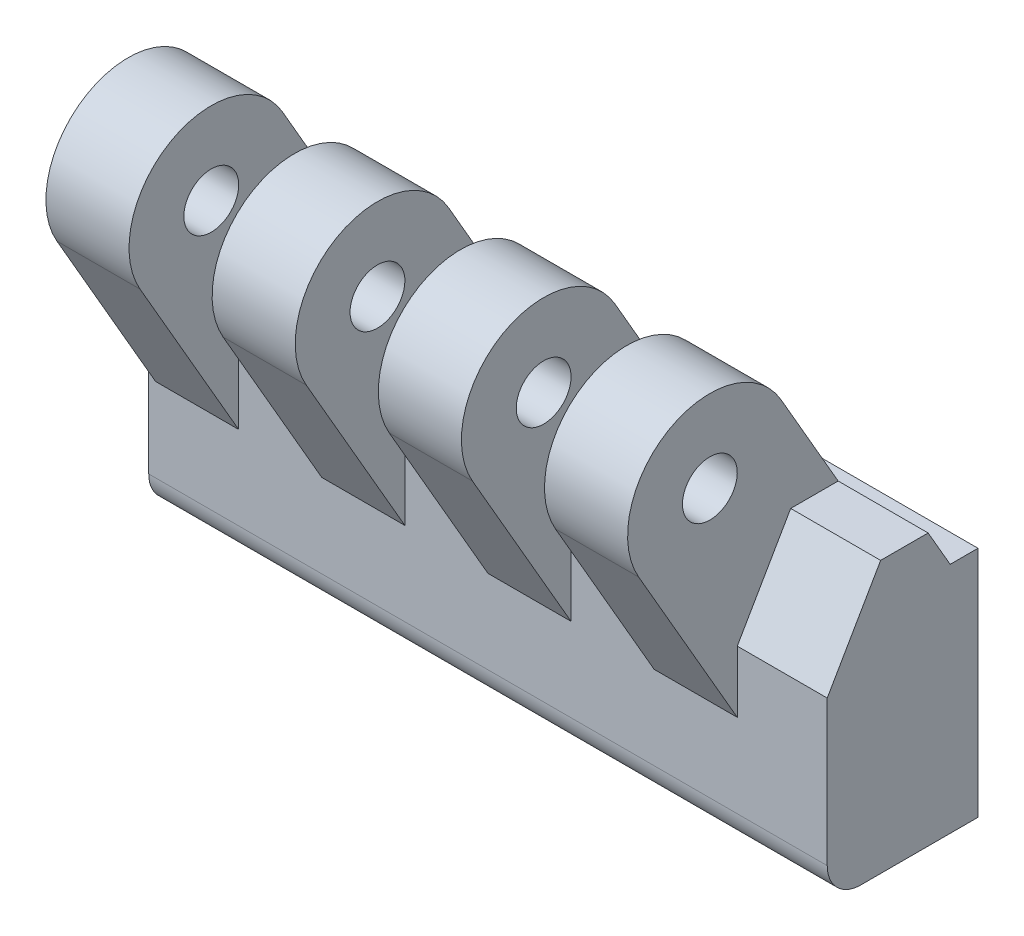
ISO-10303-21;
HEADER;
FILE_DESCRIPTION(('STEP AP214'),'2;1');
FILE_NAME('part.step','',(''),(''),'','','');
FILE_SCHEMA(('AUTOMOTIVE_DESIGN { 1 0 10303 214 1 1 1 1 }'));
ENDSEC;
DATA;
#1=APPLICATION_CONTEXT('core data for automotive mechanical design processes');
#2=APPLICATION_PROTOCOL_DEFINITION('international standard','automotive_design',2000,#1);
#3=PRODUCT_CONTEXT('',#1,'mechanical');
#4=PRODUCT('Part','Part','',(#3));
#5=PRODUCT_RELATED_PRODUCT_CATEGORY('part','',(#4));
#6=PRODUCT_DEFINITION_FORMATION('','',#4);
#7=PRODUCT_DEFINITION_CONTEXT('part definition',#1,'design');
#8=PRODUCT_DEFINITION('design','',#6,#7);
#9=PRODUCT_DEFINITION_SHAPE('','',#8);
#10=(LENGTH_UNIT() NAMED_UNIT(*) SI_UNIT(.MILLI.,.METRE.));
#11=(NAMED_UNIT(*) PLANE_ANGLE_UNIT() SI_UNIT($,.RADIAN.));
#12=(NAMED_UNIT(*) SI_UNIT($,.STERADIAN.) SOLID_ANGLE_UNIT());
#13=UNCERTAINTY_MEASURE_WITH_UNIT(LENGTH_MEASURE(1.E-05),#10,'distance_accuracy_value','');
#14=(GEOMETRIC_REPRESENTATION_CONTEXT(3) GLOBAL_UNCERTAINTY_ASSIGNED_CONTEXT((#13)) GLOBAL_UNIT_ASSIGNED_CONTEXT((#10,
#11,#12)) REPRESENTATION_CONTEXT('',''));
#15=CARTESIAN_POINT('',(0.,0.,0.));
#16=DIRECTION('',(0.,0.,1.));
#17=DIRECTION('',(1.,0.,0.));
#18=AXIS2_PLACEMENT_3D('',#15,#16,#17);
#19=CARTESIAN_POINT('',(40.,11.2857142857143,3.63867777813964));
#20=DIRECTION('',(0.,-1.,0.));
#21=DIRECTION('',(0.,0.,-1.));
#22=AXIS2_PLACEMENT_3D('',#19,#20,#21);
#23=PLANE('',#22);
#24=DIRECTION('',(0.,0.,1.));
#25=VECTOR('',#24,1.);
#26=CARTESIAN_POINT('',(27.375,11.2857142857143,3.63867777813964));
#27=LINE('',#26,#25);
#28=CARTESIAN_POINT('',(27.375,11.2857142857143,3.63867777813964));
#29=VERTEX_POINT('',#28);
#30=CARTESIAN_POINT('',(27.375,11.2857142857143,7.1027793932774));
#31=VERTEX_POINT('',#30);
#32=EDGE_CURVE('E242',#29,#31,#27,.T.);
#33=ORIENTED_EDGE('',*,*,#32,.F.);
#34=DIRECTION('',(-1.,0.,0.));
#35=VECTOR('',#34,1.);
#36=CARTESIAN_POINT('',(40.,11.2857142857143,3.63867777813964));
#37=LINE('',#36,#35);
#38=CARTESIAN_POINT('',(21.3125,11.2857142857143,3.63867777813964));
#39=VERTEX_POINT('',#38);
#40=EDGE_CURVE('E443',#29,#39,#37,.T.);
#41=ORIENTED_EDGE('',*,*,#40,.T.);
#42=DIRECTION('',(0.,0.,1.));
#43=VECTOR('',#42,1.);
#44=CARTESIAN_POINT('',(21.3125,11.2857142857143,3.63867777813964));
#45=LINE('',#44,#43);
#46=CARTESIAN_POINT('',(21.3125,11.2857142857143,7.1027793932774));
#47=VERTEX_POINT('',#46);
#48=EDGE_CURVE('E384',#39,#47,#45,.T.);
#49=ORIENTED_EDGE('',*,*,#48,.T.);
#50=DIRECTION('',(-1.,0.,0.));
#51=VECTOR('',#50,1.);
#52=CARTESIAN_POINT('',(40.,11.2857142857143,7.1027793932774));
#53=LINE('',#52,#51);
#54=EDGE_CURVE('E438',#31,#47,#53,.T.);
#55=ORIENTED_EDGE('',*,*,#54,.F.);
#56=EDGE_LOOP('',(#33,#41,#49,#55));
#57=FACE_BOUND('',#56,.T.);
#58=ADVANCED_FACE('F14',(#57),#23,.F.);
#59=CARTESIAN_POINT('',(40.,11.2857142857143,7.1027793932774));
#60=DIRECTION('',(0.,-0.5,-0.866025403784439));
#61=DIRECTION('',(0.,0.866025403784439,-0.5));
#62=AXIS2_PLACEMENT_3D('',#59,#60,#61);
#63=PLANE('',#62);
#64=DIRECTION('',(0.,-0.866025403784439,0.5));
#65=VECTOR('',#64,1.);
#66=CARTESIAN_POINT('',(27.375,11.2857142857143,7.1027793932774));
#67=LINE('',#66,#65);
#68=CARTESIAN_POINT('',(27.375,4.53553018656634,11.));
#69=VERTEX_POINT('',#68);
#70=EDGE_CURVE('E474',#31,#69,#67,.T.);
#71=ORIENTED_EDGE('',*,*,#70,.F.);
#72=ORIENTED_EDGE('',*,*,#54,.T.);
#73=DIRECTION('',(0.,-0.866025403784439,0.5));
#74=VECTOR('',#73,1.);
#75=CARTESIAN_POINT('',(21.3125,11.2857142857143,7.1027793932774));
#76=LINE('',#75,#74);
#77=CARTESIAN_POINT('',(21.3125,4.53553018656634,11.));
#78=VERTEX_POINT('',#77);
#79=EDGE_CURVE('E381',#47,#78,#76,.T.);
#80=ORIENTED_EDGE('',*,*,#79,.T.);
#81=DIRECTION('',(-1.,0.,0.));
#82=VECTOR('',#81,1.);
#83=CARTESIAN_POINT('',(40.,4.53553018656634,11.));
#84=LINE('',#83,#82);
#85=EDGE_CURVE('E432',#69,#78,#84,.T.);
#86=ORIENTED_EDGE('',*,*,#85,.F.);
#87=EDGE_LOOP('',(#71,#72,#80,#86));
#88=FACE_BOUND('',#87,.T.);
#89=ADVANCED_FACE('F492',(#88),#63,.F.);
#90=DIRECTION('',(0.,0.,1.));
#91=VECTOR('',#90,1.);
#92=CARTESIAN_POINT('',(-9.,11.2857142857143,3.63867777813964));
#93=LINE('',#92,#91);
#94=CARTESIAN_POINT('',(-9.,11.2857142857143,3.63867777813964));
#95=VERTEX_POINT('',#94);
#96=CARTESIAN_POINT('',(-9.,11.2857142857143,7.1027793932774));
#97=VERTEX_POINT('',#96);
#98=EDGE_CURVE('E311',#95,#97,#93,.T.);
#99=ORIENTED_EDGE('',*,*,#98,.F.);
#100=CARTESIAN_POINT('',(-9.5,11.2857142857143,3.63867777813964));
#101=VERTEX_POINT('',#100);
#102=EDGE_CURVE('E437',#95,#101,#37,.T.);
#103=ORIENTED_EDGE('',*,*,#102,.T.);
#104=DIRECTION('',(0.,0.,1.));
#105=VECTOR('',#104,1.);
#106=CARTESIAN_POINT('',(-9.5,11.2857142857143,3.63867777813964));
#107=LINE('',#106,#105);
#108=CARTESIAN_POINT('',(-9.5,11.2857142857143,7.1027793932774));
#109=VERTEX_POINT('',#108);
#110=EDGE_CURVE('E419',#101,#109,#107,.T.);
#111=ORIENTED_EDGE('',*,*,#110,.T.);
#112=EDGE_CURVE('E431',#97,#109,#53,.T.);
#113=ORIENTED_EDGE('',*,*,#112,.F.);
#114=EDGE_LOOP('',(#99,#103,#111,#113));
#115=FACE_BOUND('',#114,.T.);
#116=ADVANCED_FACE('F532',(#115),#23,.F.);
#117=DIRECTION('',(0.,-0.866025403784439,0.5));
#118=VECTOR('',#117,1.);
#119=CARTESIAN_POINT('',(-9.,11.2857142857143,7.1027793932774));
#120=LINE('',#119,#118);
#121=CARTESIAN_POINT('',(-9.,4.53553018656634,11.));
#122=VERTEX_POINT('',#121);
#123=EDGE_CURVE('E309',#97,#122,#120,.T.);
#124=ORIENTED_EDGE('',*,*,#123,.F.);
#125=ORIENTED_EDGE('',*,*,#112,.T.);
#126=DIRECTION('',(0.,-0.866025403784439,0.5));
#127=VECTOR('',#126,1.);
#128=CARTESIAN_POINT('',(-9.5,11.2857142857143,7.1027793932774));
#129=LINE('',#128,#127);
#130=CARTESIAN_POINT('',(-9.5,4.53553018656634,11.));
#131=VERTEX_POINT('',#130);
#132=EDGE_CURVE('E422',#109,#131,#129,.T.);
#133=ORIENTED_EDGE('',*,*,#132,.T.);
#134=EDGE_CURVE('E428',#122,#131,#84,.T.);
#135=ORIENTED_EDGE('',*,*,#134,.F.);
#136=EDGE_LOOP('',(#124,#125,#133,#135));
#137=FACE_BOUND('',#136,.T.);
#138=ADVANCED_FACE('F525',(#137),#63,.F.);
#139=CARTESIAN_POINT('',(40.,4.53553018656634,11.));
#140=DIRECTION('',(0.,0.,-1.));
#141=DIRECTION('',(-1.,0.,0.));
#142=AXIS2_PLACEMENT_3D('',#139,#140,#141);
#143=PLANE('',#142);
#144=CARTESIAN_POINT('',(40.,4.53553018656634,11.));
#145=VERTEX_POINT('',#144);
#146=CARTESIAN_POINT('',(33.4375,4.53553018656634,11.));
#147=VERTEX_POINT('',#146);
#148=EDGE_CURVE('E429',#145,#147,#84,.T.);
#149=ORIENTED_EDGE('',*,*,#148,.T.);
#150=DIRECTION('',(0.,-1.,0.));
#151=VECTOR('',#150,1.);
#152=CARTESIAN_POINT('',(33.4375,4.53553018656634,11.));
#153=LINE('',#152,#151);
#154=CARTESIAN_POINT('',(33.4375,0.0358983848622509,11.));
#155=VERTEX_POINT('',#154);
#156=EDGE_CURVE('E29',#147,#155,#153,.T.);
#157=ORIENTED_EDGE('',*,*,#156,.T.);
#158=DIRECTION('',(1.,0.,0.));
#159=VECTOR('',#158,1.);
#160=CARTESIAN_POINT('',(40.,0.0358983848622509,11.));
#161=LINE('',#160,#159);
#162=CARTESIAN_POINT('',(27.375,0.0358983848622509,11.));
#163=VERTEX_POINT('',#162);
#164=EDGE_CURVE('E9',#163,#155,#161,.T.);
#165=ORIENTED_EDGE('',*,*,#164,.F.);
#166=DIRECTION('',(0.,-1.,0.));
#167=VECTOR('',#166,1.);
#168=CARTESIAN_POINT('',(27.375,4.53553018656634,11.));
#169=LINE('',#168,#167);
#170=EDGE_CURVE('E268',#69,#163,#169,.T.);
#171=ORIENTED_EDGE('',*,*,#170,.F.);
#172=ORIENTED_EDGE('',*,*,#85,.T.);
#173=DIRECTION('',(0.,-1.,0.));
#174=VECTOR('',#173,1.);
#175=CARTESIAN_POINT('',(21.3125,4.53553018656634,11.));
#176=LINE('',#175,#174);
#177=CARTESIAN_POINT('',(21.3125,0.0358983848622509,11.));
#178=VERTEX_POINT('',#177);
#179=EDGE_CURVE('E461',#78,#178,#176,.T.);
#180=ORIENTED_EDGE('',*,*,#179,.T.);
#181=DIRECTION('',(1.,0.,0.));
#182=VECTOR('',#181,1.);
#183=CARTESIAN_POINT('',(40.,0.0358983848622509,11.));
#184=LINE('',#183,#182);
#185=CARTESIAN_POINT('',(15.25,0.0358983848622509,11.));
#186=VERTEX_POINT('',#185);
#187=EDGE_CURVE('E458',#186,#178,#184,.T.);
#188=ORIENTED_EDGE('',*,*,#187,.F.);
#189=DIRECTION('',(0.,-1.,0.));
#190=VECTOR('',#189,1.);
#191=CARTESIAN_POINT('',(15.25,4.53553018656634,11.));
#192=LINE('',#191,#190);
#193=CARTESIAN_POINT('',(15.25,4.53553018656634,11.));
#194=VERTEX_POINT('',#193);
#195=EDGE_CURVE('E455',#194,#186,#192,.T.);
#196=ORIENTED_EDGE('',*,*,#195,.F.);
#197=CARTESIAN_POINT('',(9.1875,4.53553018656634,11.));
#198=VERTEX_POINT('',#197);
#199=EDGE_CURVE('E433',#194,#198,#84,.T.);
#200=ORIENTED_EDGE('',*,*,#199,.T.);
#201=DIRECTION('',(0.,-1.,0.));
#202=VECTOR('',#201,1.);
#203=CARTESIAN_POINT('',(9.1875,4.53553018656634,11.));
#204=LINE('',#203,#202);
#205=CARTESIAN_POINT('',(9.1875,0.0358983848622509,11.));
#206=VERTEX_POINT('',#205);
#207=EDGE_CURVE('E463',#198,#206,#204,.T.);
#208=ORIENTED_EDGE('',*,*,#207,.T.);
#209=DIRECTION('',(-1.,0.,0.));
#210=VECTOR('',#209,1.);
#211=CARTESIAN_POINT('',(40.,0.0358983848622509,11.));
#212=LINE('',#211,#210);
#213=CARTESIAN_POINT('',(3.125,0.0358983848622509,11.));
#214=VERTEX_POINT('',#213);
#215=EDGE_CURVE('E466',#206,#214,#212,.T.);
#216=ORIENTED_EDGE('',*,*,#215,.T.);
#217=DIRECTION('',(0.,-1.,0.));
#218=VECTOR('',#217,1.);
#219=CARTESIAN_POINT('',(3.125,4.53553018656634,11.));
#220=LINE('',#219,#218);
#221=CARTESIAN_POINT('',(3.125,4.53553018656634,11.));
#222=VERTEX_POINT('',#221);
#223=EDGE_CURVE('E469',#222,#214,#220,.T.);
#224=ORIENTED_EDGE('',*,*,#223,.F.);
#225=CARTESIAN_POINT('',(-2.9375,4.53553018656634,11.));
#226=VERTEX_POINT('',#225);
#227=EDGE_CURVE('E1040',#222,#226,#84,.T.);
#228=ORIENTED_EDGE('',*,*,#227,.T.);
#229=DIRECTION('',(0.,-1.,0.));
#230=VECTOR('',#229,1.);
#231=CARTESIAN_POINT('',(-2.9375,4.53553018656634,11.));
#232=LINE('',#231,#230);
#233=CARTESIAN_POINT('',(-2.9375,0.0358983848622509,11.));
#234=VERTEX_POINT('',#233);
#235=EDGE_CURVE('E298',#226,#234,#232,.T.);
#236=ORIENTED_EDGE('',*,*,#235,.T.);
#237=DIRECTION('',(-1.,0.,0.));
#238=VECTOR('',#237,1.);
#239=CARTESIAN_POINT('',(40.,0.0358983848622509,11.));
#240=LINE('',#239,#238);
#241=CARTESIAN_POINT('',(-9.,0.0358983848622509,11.));
#242=VERTEX_POINT('',#241);
#243=EDGE_CURVE('E471',#234,#242,#240,.T.);
#244=ORIENTED_EDGE('',*,*,#243,.T.);
#245=DIRECTION('',(0.,-1.,0.));
#246=VECTOR('',#245,1.);
#247=CARTESIAN_POINT('',(-9.,4.53553018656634,11.));
#248=LINE('',#247,#246);
#249=EDGE_CURVE('E307',#122,#242,#248,.T.);
#250=ORIENTED_EDGE('',*,*,#249,.F.);
#251=ORIENTED_EDGE('',*,*,#134,.T.);
#252=DIRECTION('',(0.,-1.,0.));
#253=VECTOR('',#252,1.);
#254=CARTESIAN_POINT('',(-9.5,4.53553018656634,11.));
#255=LINE('',#254,#253);
#256=CARTESIAN_POINT('',(-9.5,-6.05555555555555,11.));
#257=VERTEX_POINT('',#256);
#258=EDGE_CURVE('E392',#131,#257,#255,.T.);
#259=ORIENTED_EDGE('',*,*,#258,.T.);
#260=DIRECTION('',(-1.,0.,0.));
#261=VECTOR('',#260,1.);
#262=CARTESIAN_POINT('',(40.,-6.05555555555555,11.));
#263=LINE('',#262,#261);
#264=CARTESIAN_POINT('',(40.,-6.05555555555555,11.));
#265=VERTEX_POINT('',#264);
#266=EDGE_CURVE('E406',#265,#257,#263,.T.);
#267=ORIENTED_EDGE('',*,*,#266,.F.);
#268=DIRECTION('',(0.,-1.,0.));
#269=VECTOR('',#268,1.);
#270=CARTESIAN_POINT('',(40.,4.53553018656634,11.));
#271=LINE('',#270,#269);
#272=EDGE_CURVE('E404',#145,#265,#271,.T.);
#273=ORIENTED_EDGE('',*,*,#272,.F.);
#274=EDGE_LOOP('',(#149,#157,#165,#171,#172,#180,#188,#196,#200,#208,#216,#224,#228,#236,#244,
#250,#251,#259,#267,#273));
#275=FACE_BOUND('',#274,.T.);
#276=ADVANCED_FACE('F482',(#275),#143,.F.);
#277=CARTESIAN_POINT('',(3.125,11.2857142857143,3.63867777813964));
#278=VERTEX_POINT('',#277);
#279=CARTESIAN_POINT('',(-2.9375,11.2857142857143,3.63867777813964));
#280=VERTEX_POINT('',#279);
#281=EDGE_CURVE('E604',#278,#280,#37,.T.);
#282=ORIENTED_EDGE('',*,*,#281,.T.);
#283=DIRECTION('',(0.,0.,1.));
#284=VECTOR('',#283,1.);
#285=CARTESIAN_POINT('',(-2.9375,11.2857142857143,3.63867777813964));
#286=LINE('',#285,#284);
#287=CARTESIAN_POINT('',(-2.9375,11.2857142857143,7.1027793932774));
#288=VERTEX_POINT('',#287);
#289=EDGE_CURVE('E304',#280,#288,#286,.T.);
#290=ORIENTED_EDGE('',*,*,#289,.T.);
#291=CARTESIAN_POINT('',(3.125,11.2857142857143,7.1027793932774));
#292=VERTEX_POINT('',#291);
#293=EDGE_CURVE('E517',#292,#288,#53,.T.);
#294=ORIENTED_EDGE('',*,*,#293,.F.);
#295=DIRECTION('',(0.,0.,1.));
#296=VECTOR('',#295,1.);
#297=CARTESIAN_POINT('',(3.125,11.2857142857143,3.63867777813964));
#298=LINE('',#297,#296);
#299=EDGE_CURVE('E347',#278,#292,#298,.T.);
#300=ORIENTED_EDGE('',*,*,#299,.F.);
#301=EDGE_LOOP('',(#282,#290,#294,#300));
#302=FACE_BOUND('',#301,.T.);
#303=ADVANCED_FACE('F580',(#302),#23,.F.);
#304=ORIENTED_EDGE('',*,*,#293,.T.);
#305=DIRECTION('',(0.,-0.866025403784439,0.5));
#306=VECTOR('',#305,1.);
#307=CARTESIAN_POINT('',(-2.9375,11.2857142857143,7.1027793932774));
#308=LINE('',#307,#306);
#309=EDGE_CURVE('E301',#288,#226,#308,.T.);
#310=ORIENTED_EDGE('',*,*,#309,.T.);
#311=ORIENTED_EDGE('',*,*,#227,.F.);
#312=DIRECTION('',(0.,-0.866025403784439,0.5));
#313=VECTOR('',#312,1.);
#314=CARTESIAN_POINT('',(3.125,11.2857142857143,7.1027793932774));
#315=LINE('',#314,#313);
#316=EDGE_CURVE('E345',#292,#222,#315,.T.);
#317=ORIENTED_EDGE('',*,*,#316,.F.);
#318=EDGE_LOOP('',(#304,#310,#311,#317));
#319=FACE_BOUND('',#318,.T.);
#320=ADVANCED_FACE('F588',(#319),#63,.F.);
#321=CARTESIAN_POINT('',(15.25,11.2857142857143,3.63867777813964));
#322=VERTEX_POINT('',#321);
#323=CARTESIAN_POINT('',(9.1875,11.2857142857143,3.63867777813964));
#324=VERTEX_POINT('',#323);
#325=EDGE_CURVE('E444',#322,#324,#37,.T.);
#326=ORIENTED_EDGE('',*,*,#325,.T.);
#327=DIRECTION('',(0.,0.,1.));
#328=VECTOR('',#327,1.);
#329=CARTESIAN_POINT('',(9.1875,11.2857142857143,3.63867777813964));
#330=LINE('',#329,#328);
#331=CARTESIAN_POINT('',(9.1875,11.2857142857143,7.1027793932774));
#332=VERTEX_POINT('',#331);
#333=EDGE_CURVE('E342',#324,#332,#330,.T.);
#334=ORIENTED_EDGE('',*,*,#333,.T.);
#335=CARTESIAN_POINT('',(15.25,11.2857142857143,7.1027793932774));
#336=VERTEX_POINT('',#335);
#337=EDGE_CURVE('E439',#336,#332,#53,.T.);
#338=ORIENTED_EDGE('',*,*,#337,.F.);
#339=DIRECTION('',(0.,0.,1.));
#340=VECTOR('',#339,1.);
#341=CARTESIAN_POINT('',(15.25,11.2857142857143,3.63867777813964));
#342=LINE('',#341,#340);
#343=EDGE_CURVE('E378',#322,#336,#342,.T.);
#344=ORIENTED_EDGE('',*,*,#343,.F.);
#345=EDGE_LOOP('',(#326,#334,#338,#344));
#346=FACE_BOUND('',#345,.T.);
#347=ADVANCED_FACE('F515',(#346),#23,.F.);
#348=ORIENTED_EDGE('',*,*,#337,.T.);
#349=DIRECTION('',(0.,-0.866025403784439,0.5));
#350=VECTOR('',#349,1.);
#351=CARTESIAN_POINT('',(9.1875,11.2857142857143,7.1027793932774));
#352=LINE('',#351,#350);
#353=EDGE_CURVE('E339',#332,#198,#352,.T.);
#354=ORIENTED_EDGE('',*,*,#353,.T.);
#355=ORIENTED_EDGE('',*,*,#199,.F.);
#356=DIRECTION('',(0.,-0.866025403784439,0.5));
#357=VECTOR('',#356,1.);
#358=CARTESIAN_POINT('',(15.25,11.2857142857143,7.1027793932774));
#359=LINE('',#358,#357);
#360=EDGE_CURVE('E375',#336,#194,#359,.T.);
#361=ORIENTED_EDGE('',*,*,#360,.F.);
#362=EDGE_LOOP('',(#348,#354,#355,#361));
#363=FACE_BOUND('',#362,.T.);
#364=ADVANCED_FACE('F512',(#363),#63,.F.);
#365=CARTESIAN_POINT('',(40.,-6.05555555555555,8.55555555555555));
#366=DIRECTION('',(-1.,0.,0.));
#367=DIRECTION('',(0.,-1.,0.));
#368=AXIS2_PLACEMENT_3D('',#365,#366,#367);
#369=CYLINDRICAL_SURFACE('',#368,2.44444444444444);
#370=CARTESIAN_POINT('',(-9.5,-6.05555555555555,8.55555555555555));
#371=DIRECTION('',(1.,0.,0.));
#372=DIRECTION('',(0.,1.,0.));
#373=AXIS2_PLACEMENT_3D('',#370,#371,#372);
#374=CIRCLE('',#373,2.44444444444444);
#375=CARTESIAN_POINT('',(-9.5,-8.5,8.55555555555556));
#376=VERTEX_POINT('',#375);
#377=EDGE_CURVE('E387',#257,#376,#374,.T.);
#378=ORIENTED_EDGE('',*,*,#377,.T.);
#379=DIRECTION('',(-1.,0.,0.));
#380=VECTOR('',#379,1.);
#381=CARTESIAN_POINT('',(40.,-8.5,8.55555555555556));
#382=LINE('',#381,#380);
#383=CARTESIAN_POINT('',(40.,-8.5,8.55555555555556));
#384=VERTEX_POINT('',#383);
#385=EDGE_CURVE('E452',#384,#376,#382,.T.);
#386=ORIENTED_EDGE('',*,*,#385,.F.);
#387=CARTESIAN_POINT('',(40.,-6.05555555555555,8.55555555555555));
#388=DIRECTION('',(1.,0.,0.));
#389=DIRECTION('',(0.,1.,0.));
#390=AXIS2_PLACEMENT_3D('',#387,#388,#389);
#391=CIRCLE('',#390,2.44444444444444);
#392=EDGE_CURVE('E388',#265,#384,#391,.T.);
#393=ORIENTED_EDGE('',*,*,#392,.F.);
#394=ORIENTED_EDGE('',*,*,#266,.T.);
#395=EDGE_LOOP('',(#378,#386,#393,#394));
#396=FACE_BOUND('',#395,.T.);
#397=ADVANCED_FACE('F16',(#396),#369,.T.);
#398=CARTESIAN_POINT('',(40.,-8.5,8.55555555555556));
#399=DIRECTION('',(0.,1.,0.));
#400=DIRECTION('',(-1.,0.,0.));
#401=AXIS2_PLACEMENT_3D('',#398,#399,#400);
#402=PLANE('',#401);
#403=DIRECTION('',(0.,0.,-1.));
#404=VECTOR('',#403,1.);
#405=CARTESIAN_POINT('',(-9.5,-8.5,8.55555555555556));
#406=LINE('',#405,#404);
#407=CARTESIAN_POINT('',(-9.5,-8.5,0.));
#408=VERTEX_POINT('',#407);
#409=EDGE_CURVE('E409',#376,#408,#406,.T.);
#410=ORIENTED_EDGE('',*,*,#409,.T.);
#411=DIRECTION('',(-1.,0.,0.));
#412=VECTOR('',#411,1.);
#413=CARTESIAN_POINT('',(40.,-8.5,0.));
#414=LINE('',#413,#412);
#415=CARTESIAN_POINT('',(40.,-8.5,0.));
#416=VERTEX_POINT('',#415);
#417=EDGE_CURVE('E449',#416,#408,#414,.T.);
#418=ORIENTED_EDGE('',*,*,#417,.F.);
#419=DIRECTION('',(0.,0.,-1.));
#420=VECTOR('',#419,1.);
#421=CARTESIAN_POINT('',(40.,-8.5,8.55555555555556));
#422=LINE('',#421,#420);
#423=EDGE_CURVE('E391',#384,#416,#422,.T.);
#424=ORIENTED_EDGE('',*,*,#423,.F.);
#425=ORIENTED_EDGE('',*,*,#385,.T.);
#426=EDGE_LOOP('',(#410,#418,#424,#425));
#427=FACE_BOUND('',#426,.T.);
#428=ADVANCED_FACE('F560',(#427),#402,.F.);
#429=CARTESIAN_POINT('',(40.,-8.5,0.));
#430=DIRECTION('',(0.,0.,1.));
#431=DIRECTION('',(1.,0.,0.));
#432=AXIS2_PLACEMENT_3D('',#429,#430,#431);
#433=PLANE('',#432);
#434=CARTESIAN_POINT('',(0.,0.,0.));
#435=DIRECTION('',(0.,0.,-1.));
#436=DIRECTION('',(-1.,0.,0.));
#437=AXIS2_PLACEMENT_3D('',#434,#435,#436);
#438=CIRCLE('',#437,2.5);
#439=CARTESIAN_POINT('',(-2.5,0.,0.));
#440=VERTEX_POINT('',#439);
#441=EDGE_CURVE('E722',#440,#440,#438,.T.);
#442=ORIENTED_EDGE('',*,*,#441,.F.);
#443=EDGE_LOOP('',(#442));
#444=FACE_BOUND('',#443,.T.);
#445=CARTESIAN_POINT('',(30.5,0.,0.));
#446=DIRECTION('',(0.,0.,-1.));
#447=DIRECTION('',(-1.,0.,0.));
#448=AXIS2_PLACEMENT_3D('',#445,#446,#447);
#449=CIRCLE('',#448,2.5);
#450=CARTESIAN_POINT('',(28.,0.,0.));
#451=VERTEX_POINT('',#450);
#452=EDGE_CURVE('E724',#451,#451,#449,.T.);
#453=ORIENTED_EDGE('',*,*,#452,.F.);
#454=EDGE_LOOP('',(#453));
#455=FACE_BOUND('',#454,.T.);
#456=DIRECTION('',(0.,1.,0.));
#457=VECTOR('',#456,1.);
#458=CARTESIAN_POINT('',(-9.5,-8.5,0.));
#459=LINE('',#458,#457);
#460=CARTESIAN_POINT('',(-9.5,8.5,0.));
#461=VERTEX_POINT('',#460);
#462=EDGE_CURVE('E411',#408,#461,#459,.T.);
#463=ORIENTED_EDGE('',*,*,#462,.T.);
#464=DIRECTION('',(-1.,0.,0.));
#465=VECTOR('',#464,1.);
#466=CARTESIAN_POINT('',(40.,8.5,0.));
#467=LINE('',#466,#465);
#468=CARTESIAN_POINT('',(40.,8.5,0.));
#469=VERTEX_POINT('',#468);
#470=EDGE_CURVE('E446',#469,#461,#467,.T.);
#471=ORIENTED_EDGE('',*,*,#470,.F.);
#472=DIRECTION('',(0.,1.,0.));
#473=VECTOR('',#472,1.);
#474=CARTESIAN_POINT('',(40.,-8.5,0.));
#475=LINE('',#474,#473);
#476=EDGE_CURVE('E394',#416,#469,#475,.T.);
#477=ORIENTED_EDGE('',*,*,#476,.F.);
#478=ORIENTED_EDGE('',*,*,#417,.T.);
#479=EDGE_LOOP('',(#463,#471,#477,#478));
#480=FACE_BOUND('',#479,.T.);
#481=ADVANCED_FACE('F557',(#444,#455,#480),#433,.F.);
#482=CARTESIAN_POINT('',(40.,8.5,0.));
#483=DIRECTION('',(0.,-1.,0.));
#484=DIRECTION('',(1.,0.,0.));
#485=AXIS2_PLACEMENT_3D('',#482,#483,#484);
#486=PLANE('',#485);
#487=DIRECTION('',(0.,0.,1.));
#488=VECTOR('',#487,1.);
#489=CARTESIAN_POINT('',(-9.5,8.5,0.));
#490=LINE('',#489,#488);
#491=CARTESIAN_POINT('',(-9.5,8.5,2.03034488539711));
#492=VERTEX_POINT('',#491);
#493=EDGE_CURVE('E413',#461,#492,#490,.T.);
#494=ORIENTED_EDGE('',*,*,#493,.T.);
#495=DIRECTION('',(-1.,0.,0.));
#496=VECTOR('',#495,1.);
#497=CARTESIAN_POINT('',(40.,8.5,2.03034488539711));
#498=LINE('',#497,#496);
#499=CARTESIAN_POINT('',(40.,8.5,2.03034488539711));
#500=VERTEX_POINT('',#499);
#501=EDGE_CURVE('E442',#500,#492,#498,.T.);
#502=ORIENTED_EDGE('',*,*,#501,.F.);
#503=DIRECTION('',(0.,0.,1.));
#504=VECTOR('',#503,1.);
#505=CARTESIAN_POINT('',(40.,8.5,0.));
#506=LINE('',#505,#504);
#507=EDGE_CURVE('E396',#469,#500,#506,.T.);
#508=ORIENTED_EDGE('',*,*,#507,.F.);
#509=ORIENTED_EDGE('',*,*,#470,.T.);
#510=EDGE_LOOP('',(#494,#502,#508,#509));
#511=FACE_BOUND('',#510,.T.);
#512=ADVANCED_FACE('F553',(#511),#486,.F.);
#513=CARTESIAN_POINT('',(40.,8.5,2.03034488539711));
#514=DIRECTION('',(0.,-0.5,0.866025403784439));
#515=DIRECTION('',(0.,-0.866025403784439,-0.5));
#516=AXIS2_PLACEMENT_3D('',#513,#514,#515);
#517=PLANE('',#516);
#518=ORIENTED_EDGE('',*,*,#501,.T.);
#519=DIRECTION('',(0.,0.866025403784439,0.5));
#520=VECTOR('',#519,1.);
#521=CARTESIAN_POINT('',(-9.5,8.5,2.03034488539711));
#522=LINE('',#521,#520);
#523=EDGE_CURVE('E416',#492,#101,#522,.T.);
#524=ORIENTED_EDGE('',*,*,#523,.T.);
#525=ORIENTED_EDGE('',*,*,#102,.F.);
#526=DIRECTION('',(0.,0.866025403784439,0.5));
#527=VECTOR('',#526,1.);
#528=CARTESIAN_POINT('',(-9.,6.71539030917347,1.));
#529=LINE('',#528,#527);
#530=CARTESIAN_POINT('',(-9.,18.5,7.80384757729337));
#531=VERTEX_POINT('',#530);
#532=EDGE_CURVE('E273',#95,#531,#529,.T.);
#533=ORIENTED_EDGE('',*,*,#532,.T.);
#534=DIRECTION('',(1.,0.,0.));
#535=VECTOR('',#534,1.);
#536=CARTESIAN_POINT('',(-9.,18.5,7.80384757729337));
#537=LINE('',#536,#535);
#538=CARTESIAN_POINT('',(-2.9375,18.5,7.80384757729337));
#539=VERTEX_POINT('',#538);
#540=EDGE_CURVE('E295',#531,#539,#537,.T.);
#541=ORIENTED_EDGE('',*,*,#540,.T.);
#542=DIRECTION('',(0.,0.866025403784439,0.5));
#543=VECTOR('',#542,1.);
#544=CARTESIAN_POINT('',(-2.9375,6.71539030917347,1.));
#545=LINE('',#544,#543);
#546=EDGE_CURVE('E272',#280,#539,#545,.T.);
#547=ORIENTED_EDGE('',*,*,#546,.F.);
#548=ORIENTED_EDGE('',*,*,#281,.F.);
#549=DIRECTION('',(0.,0.866025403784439,0.5));
#550=VECTOR('',#549,1.);
#551=CARTESIAN_POINT('',(3.125,6.71539030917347,1.));
#552=LINE('',#551,#550);
#553=CARTESIAN_POINT('',(3.125,18.5,7.80384757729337));
#554=VERTEX_POINT('',#553);
#555=EDGE_CURVE('E314',#278,#554,#552,.T.);
#556=ORIENTED_EDGE('',*,*,#555,.T.);
#557=DIRECTION('',(1.,0.,0.));
#558=VECTOR('',#557,1.);
#559=CARTESIAN_POINT('',(3.125,18.5,7.80384757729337));
#560=LINE('',#559,#558);
#561=CARTESIAN_POINT('',(9.1875,18.5,7.80384757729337));
#562=VERTEX_POINT('',#561);
#563=EDGE_CURVE('E336',#554,#562,#560,.T.);
#564=ORIENTED_EDGE('',*,*,#563,.T.);
#565=DIRECTION('',(0.,0.866025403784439,0.5));
#566=VECTOR('',#565,1.);
#567=CARTESIAN_POINT('',(9.1875,6.71539030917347,1.));
#568=LINE('',#567,#566);
#569=EDGE_CURVE('E313',#324,#562,#568,.T.);
#570=ORIENTED_EDGE('',*,*,#569,.F.);
#571=ORIENTED_EDGE('',*,*,#325,.F.);
#572=DIRECTION('',(0.,0.866025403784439,0.5));
#573=VECTOR('',#572,1.);
#574=CARTESIAN_POINT('',(15.25,6.71539030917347,1.));
#575=LINE('',#574,#573);
#576=CARTESIAN_POINT('',(15.25,18.5,7.80384757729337));
#577=VERTEX_POINT('',#576);
#578=EDGE_CURVE('E349',#322,#577,#575,.T.);
#579=ORIENTED_EDGE('',*,*,#578,.T.);
#580=DIRECTION('',(-1.,0.,0.));
#581=VECTOR('',#580,1.);
#582=CARTESIAN_POINT('',(21.3125,18.5,7.80384757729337));
#583=LINE('',#582,#581);
#584=CARTESIAN_POINT('',(21.3125,18.5,7.80384757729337));
#585=VERTEX_POINT('',#584);
#586=EDGE_CURVE('E372',#585,#577,#583,.T.);
#587=ORIENTED_EDGE('',*,*,#586,.F.);
#588=DIRECTION('',(0.,0.866025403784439,0.5));
#589=VECTOR('',#588,1.);
#590=CARTESIAN_POINT('',(21.3125,6.71539030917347,1.));
#591=LINE('',#590,#589);
#592=EDGE_CURVE('E350',#39,#585,#591,.T.);
#593=ORIENTED_EDGE('',*,*,#592,.F.);
#594=ORIENTED_EDGE('',*,*,#40,.F.);
#595=DIRECTION('',(0.,0.866025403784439,0.5));
#596=VECTOR('',#595,1.);
#597=CARTESIAN_POINT('',(27.375,6.71539030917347,1.));
#598=LINE('',#597,#596);
#599=CARTESIAN_POINT('',(27.375,18.5,7.80384757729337));
#600=VERTEX_POINT('',#599);
#601=EDGE_CURVE('E239',#29,#600,#598,.T.);
#602=ORIENTED_EDGE('',*,*,#601,.T.);
#603=DIRECTION('',(-1.,0.,0.));
#604=VECTOR('',#603,1.);
#605=CARTESIAN_POINT('',(33.4375,18.5,7.80384757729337));
#606=LINE('',#605,#604);
#607=CARTESIAN_POINT('',(33.4375,18.5,7.80384757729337));
#608=VERTEX_POINT('',#607);
#609=EDGE_CURVE('E235',#608,#600,#606,.T.);
#610=ORIENTED_EDGE('',*,*,#609,.F.);
#611=DIRECTION('',(0.,0.866025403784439,0.5));
#612=VECTOR('',#611,1.);
#613=CARTESIAN_POINT('',(33.4375,6.71539030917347,1.));
#614=LINE('',#613,#612);
#615=CARTESIAN_POINT('',(33.4375,11.2857142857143,3.63867777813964));
#616=VERTEX_POINT('',#615);
#617=EDGE_CURVE('E221',#616,#608,#614,.T.);
#618=ORIENTED_EDGE('',*,*,#617,.F.);
#619=CARTESIAN_POINT('',(40.,11.2857142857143,3.63867777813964));
#620=VERTEX_POINT('',#619);
#621=EDGE_CURVE('E440',#620,#616,#37,.T.);
#622=ORIENTED_EDGE('',*,*,#621,.F.);
#623=DIRECTION('',(0.,0.866025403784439,0.5));
#624=VECTOR('',#623,1.);
#625=CARTESIAN_POINT('',(40.,8.5,2.03034488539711));
#626=LINE('',#625,#624);
#627=EDGE_CURVE('E398',#500,#620,#626,.T.);
#628=ORIENTED_EDGE('',*,*,#627,.F.);
#629=EDGE_LOOP('',(#518,#524,#525,#533,#541,#547,#548,#556,#564,#570,#571,#579,#587,#593,#594,
#602,#610,#618,#622,#628));
#630=FACE_BOUND('',#629,.T.);
#631=ADVANCED_FACE('F236',(#630),#517,.F.);
#632=ORIENTED_EDGE('',*,*,#621,.T.);
#633=DIRECTION('',(0.,0.,1.));
#634=VECTOR('',#633,1.);
#635=CARTESIAN_POINT('',(33.4375,11.2857142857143,3.63867777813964));
#636=LINE('',#635,#634);
#637=CARTESIAN_POINT('',(33.4375,11.2857142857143,7.1027793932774));
#638=VERTEX_POINT('',#637);
#639=EDGE_CURVE('E229',#616,#638,#636,.T.);
#640=ORIENTED_EDGE('',*,*,#639,.T.);
#641=CARTESIAN_POINT('',(40.,11.2857142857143,7.1027793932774));
#642=VERTEX_POINT('',#641);
#643=EDGE_CURVE('E434',#642,#638,#53,.T.);
#644=ORIENTED_EDGE('',*,*,#643,.F.);
#645=DIRECTION('',(0.,0.,1.));
#646=VECTOR('',#645,1.);
#647=CARTESIAN_POINT('',(40.,11.2857142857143,3.63867777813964));
#648=LINE('',#647,#646);
#649=EDGE_CURVE('E400',#620,#642,#648,.T.);
#650=ORIENTED_EDGE('',*,*,#649,.F.);
#651=EDGE_LOOP('',(#632,#640,#644,#650));
#652=FACE_BOUND('',#651,.T.);
#653=ADVANCED_FACE('F548',(#652),#23,.F.);
#654=ORIENTED_EDGE('',*,*,#643,.T.);
#655=DIRECTION('',(0.,-0.866025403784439,0.5));
#656=VECTOR('',#655,1.);
#657=CARTESIAN_POINT('',(33.4375,11.2857142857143,7.1027793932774));
#658=LINE('',#657,#656);
#659=EDGE_CURVE('E22',#638,#147,#658,.T.);
#660=ORIENTED_EDGE('',*,*,#659,.T.);
#661=ORIENTED_EDGE('',*,*,#148,.F.);
#662=DIRECTION('',(0.,-0.866025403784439,0.5));
#663=VECTOR('',#662,1.);
#664=CARTESIAN_POINT('',(40.,11.2857142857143,7.1027793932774));
#665=LINE('',#664,#663);
#666=EDGE_CURVE('E402',#642,#145,#665,.T.);
#667=ORIENTED_EDGE('',*,*,#666,.F.);
#668=EDGE_LOOP('',(#654,#660,#661,#667));
#669=FACE_BOUND('',#668,.T.);
#670=ADVANCED_FACE('F478',(#669),#63,.F.);
#671=CARTESIAN_POINT('',(40.,-6.05555555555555,8.55555555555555));
#672=DIRECTION('',(1.,0.,0.));
#673=DIRECTION('',(0.,1.,0.));
#674=AXIS2_PLACEMENT_3D('',#671,#672,#673);
#675=PLANE('',#674);
#676=ORIENTED_EDGE('',*,*,#392,.T.);
#677=ORIENTED_EDGE('',*,*,#423,.T.);
#678=ORIENTED_EDGE('',*,*,#476,.T.);
#679=ORIENTED_EDGE('',*,*,#507,.T.);
#680=ORIENTED_EDGE('',*,*,#627,.T.);
#681=ORIENTED_EDGE('',*,*,#649,.T.);
#682=ORIENTED_EDGE('',*,*,#666,.T.);
#683=ORIENTED_EDGE('',*,*,#272,.T.);
#684=EDGE_LOOP('',(#676,#677,#678,#679,#680,#681,#682,#683));
#685=FACE_BOUND('',#684,.T.);
#686=ADVANCED_FACE('F543',(#685),#675,.T.);
#687=CARTESIAN_POINT('',(-9.5,-6.05555555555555,8.55555555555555));
#688=DIRECTION('',(1.,0.,0.));
#689=DIRECTION('',(0.,1.,0.));
#690=AXIS2_PLACEMENT_3D('',#687,#688,#689);
#691=PLANE('',#690);
#692=ORIENTED_EDGE('',*,*,#377,.F.);
#693=ORIENTED_EDGE('',*,*,#258,.F.);
#694=ORIENTED_EDGE('',*,*,#132,.F.);
#695=ORIENTED_EDGE('',*,*,#110,.F.);
#696=ORIENTED_EDGE('',*,*,#523,.F.);
#697=ORIENTED_EDGE('',*,*,#493,.F.);
#698=ORIENTED_EDGE('',*,*,#462,.F.);
#699=ORIENTED_EDGE('',*,*,#409,.F.);
#700=EDGE_LOOP('',(#692,#693,#694,#695,#696,#697,#698,#699));
#701=FACE_BOUND('',#700,.T.);
#702=ADVANCED_FACE('F537',(#701),#691,.F.);
#703=CARTESIAN_POINT('',(21.3125,12.5,18.1961524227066));
#704=DIRECTION('',(0.,0.5,-0.866025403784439));
#705=DIRECTION('',(0.,0.866025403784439,0.5));
#706=AXIS2_PLACEMENT_3D('',#703,#704,#705);
#707=PLANE('',#706);
#708=DIRECTION('',(0.,-0.866025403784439,-0.5));
#709=VECTOR('',#708,1.);
#710=CARTESIAN_POINT('',(15.25,12.5,18.1961524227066));
#711=LINE('',#710,#709);
#712=CARTESIAN_POINT('',(15.25,12.5,18.1961524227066));
#713=VERTEX_POINT('',#712);
#714=EDGE_CURVE('E365',#713,#186,#711,.T.);
#715=ORIENTED_EDGE('',*,*,#714,.T.);
#716=ORIENTED_EDGE('',*,*,#187,.T.);
#717=DIRECTION('',(0.,-0.866025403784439,-0.5));
#718=VECTOR('',#717,1.);
#719=CARTESIAN_POINT('',(21.3125,12.5,18.1961524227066));
#720=LINE('',#719,#718);
#721=CARTESIAN_POINT('',(21.3125,12.5,18.1961524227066));
#722=VERTEX_POINT('',#721);
#723=EDGE_CURVE('E355',#722,#178,#720,.T.);
#724=ORIENTED_EDGE('',*,*,#723,.F.);
#725=DIRECTION('',(-1.,0.,0.));
#726=VECTOR('',#725,1.);
#727=CARTESIAN_POINT('',(21.3125,12.5,18.1961524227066));
#728=LINE('',#727,#726);
#729=EDGE_CURVE('E361',#722,#713,#728,.T.);
#730=ORIENTED_EDGE('',*,*,#729,.T.);
#731=EDGE_LOOP('',(#715,#716,#724,#730));
#732=FACE_BOUND('',#731,.T.);
#733=ADVANCED_FACE('F501',(#732),#707,.F.);
#734=CARTESIAN_POINT('',(21.3125,15.5,13.));
#735=DIRECTION('',(1.,0.,0.));
#736=DIRECTION('',(0.,1.,0.));
#737=AXIS2_PLACEMENT_3D('',#734,#735,#736);
#738=PLANE('',#737);
#739=CARTESIAN_POINT('',(21.3125,15.5,13.));
#740=DIRECTION('',(1.,0.,0.));
#741=DIRECTION('',(0.,1.,0.));
#742=AXIS2_PLACEMENT_3D('',#739,#740,#741);
#743=CIRCLE('',#742,2.);
#744=CARTESIAN_POINT('',(21.3125,17.5,13.));
#745=VERTEX_POINT('',#744);
#746=EDGE_CURVE('E358',#745,#745,#743,.T.);
#747=ORIENTED_EDGE('',*,*,#746,.F.);
#748=EDGE_LOOP('',(#747));
#749=FACE_BOUND('',#748,.T.);
#750=ORIENTED_EDGE('',*,*,#48,.F.);
#751=ORIENTED_EDGE('',*,*,#592,.T.);
#752=CARTESIAN_POINT('',(21.3125,15.5,13.));
#753=DIRECTION('',(1.,0.,0.));
#754=DIRECTION('',(0.,1.,0.));
#755=AXIS2_PLACEMENT_3D('',#752,#753,#754);
#756=CIRCLE('',#755,6.);
#757=EDGE_CURVE('E352',#585,#722,#756,.T.);
#758=ORIENTED_EDGE('',*,*,#757,.T.);
#759=ORIENTED_EDGE('',*,*,#723,.T.);
#760=ORIENTED_EDGE('',*,*,#179,.F.);
#761=ORIENTED_EDGE('',*,*,#79,.F.);
#762=EDGE_LOOP('',(#750,#751,#758,#759,#760,#761));
#763=FACE_BOUND('',#762,.T.);
#764=ADVANCED_FACE('F496',(#749,#763),#738,.T.);
#765=CARTESIAN_POINT('',(15.25,15.5,13.));
#766=DIRECTION('',(1.,0.,0.));
#767=DIRECTION('',(0.,1.,0.));
#768=AXIS2_PLACEMENT_3D('',#765,#766,#767);
#769=PLANE('',#768);
#770=CARTESIAN_POINT('',(15.25,15.5,13.));
#771=DIRECTION('',(1.,0.,0.));
#772=DIRECTION('',(0.,1.,0.));
#773=AXIS2_PLACEMENT_3D('',#770,#771,#772);
#774=CIRCLE('',#773,2.);
#775=CARTESIAN_POINT('',(15.25,17.5,13.));
#776=VERTEX_POINT('',#775);
#777=EDGE_CURVE('E353',#776,#776,#774,.T.);
#778=ORIENTED_EDGE('',*,*,#777,.T.);
#779=EDGE_LOOP('',(#778));
#780=FACE_BOUND('',#779,.T.);
#781=ORIENTED_EDGE('',*,*,#578,.F.);
#782=ORIENTED_EDGE('',*,*,#343,.T.);
#783=ORIENTED_EDGE('',*,*,#360,.T.);
#784=ORIENTED_EDGE('',*,*,#195,.T.);
#785=ORIENTED_EDGE('',*,*,#714,.F.);
#786=CARTESIAN_POINT('',(15.25,15.5,13.));
#787=DIRECTION('',(1.,0.,0.));
#788=DIRECTION('',(0.,1.,0.));
#789=AXIS2_PLACEMENT_3D('',#786,#787,#788);
#790=CIRCLE('',#789,6.);
#791=EDGE_CURVE('E363',#577,#713,#790,.T.);
#792=ORIENTED_EDGE('',*,*,#791,.F.);
#793=EDGE_LOOP('',(#781,#782,#783,#784,#785,#792));
#794=FACE_BOUND('',#793,.T.);
#795=ADVANCED_FACE('F507',(#780,#794),#769,.F.);
#796=CARTESIAN_POINT('',(21.3125,15.5,13.));
#797=DIRECTION('',(-1.,0.,0.));
#798=DIRECTION('',(0.,-1.,0.));
#799=AXIS2_PLACEMENT_3D('',#796,#797,#798);
#800=CYLINDRICAL_SURFACE('',#799,6.);
#801=ORIENTED_EDGE('',*,*,#791,.T.);
#802=ORIENTED_EDGE('',*,*,#729,.F.);
#803=ORIENTED_EDGE('',*,*,#757,.F.);
#804=ORIENTED_EDGE('',*,*,#586,.T.);
#805=EDGE_LOOP('',(#801,#802,#803,#804));
#806=FACE_BOUND('',#805,.T.);
#807=ADVANCED_FACE('F609',(#806),#800,.T.);
#808=CARTESIAN_POINT('',(21.3125,15.5,13.));
#809=DIRECTION('',(-1.,0.,0.));
#810=DIRECTION('',(0.,-1.,0.));
#811=AXIS2_PLACEMENT_3D('',#808,#809,#810);
#812=CYLINDRICAL_SURFACE('',#811,2.);
#813=ORIENTED_EDGE('',*,*,#746,.T.);
#814=EDGE_LOOP('',(#813));
#815=FACE_BOUND('',#814,.T.);
#816=ORIENTED_EDGE('',*,*,#777,.F.);
#817=EDGE_LOOP('',(#816));
#818=FACE_BOUND('',#817,.T.);
#819=ADVANCED_FACE('F611',(#815,#818),#812,.F.);
#820=CARTESIAN_POINT('',(3.125,12.5,18.1961524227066));
#821=DIRECTION('',(0.,-0.5,0.866025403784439));
#822=DIRECTION('',(0.,-0.866025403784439,-0.5));
#823=AXIS2_PLACEMENT_3D('',#820,#821,#822);
#824=PLANE('',#823);
#825=ORIENTED_EDGE('',*,*,#215,.F.);
#826=DIRECTION('',(0.,-0.866025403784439,-0.5));
#827=VECTOR('',#826,1.);
#828=CARTESIAN_POINT('',(9.1875,12.5,18.1961524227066));
#829=LINE('',#828,#827);
#830=CARTESIAN_POINT('',(9.1875,12.5,18.1961524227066));
#831=VERTEX_POINT('',#830);
#832=EDGE_CURVE('E331',#831,#206,#829,.T.);
#833=ORIENTED_EDGE('',*,*,#832,.F.);
#834=DIRECTION('',(1.,0.,0.));
#835=VECTOR('',#834,1.);
#836=CARTESIAN_POINT('',(3.125,12.5,18.1961524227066));
#837=LINE('',#836,#835);
#838=CARTESIAN_POINT('',(3.125,12.5,18.1961524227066));
#839=VERTEX_POINT('',#838);
#840=EDGE_CURVE('E326',#839,#831,#837,.T.);
#841=ORIENTED_EDGE('',*,*,#840,.F.);
#842=DIRECTION('',(0.,-0.866025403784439,-0.5));
#843=VECTOR('',#842,1.);
#844=CARTESIAN_POINT('',(3.125,12.5,18.1961524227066));
#845=LINE('',#844,#843);
#846=EDGE_CURVE('E320',#839,#214,#845,.T.);
#847=ORIENTED_EDGE('',*,*,#846,.T.);
#848=EDGE_LOOP('',(#825,#833,#841,#847));
#849=FACE_BOUND('',#848,.T.);
#850=ADVANCED_FACE('F618',(#849),#824,.T.);
#851=CARTESIAN_POINT('',(3.125,15.5,13.));
#852=DIRECTION('',(1.,0.,0.));
#853=DIRECTION('',(0.,1.,0.));
#854=AXIS2_PLACEMENT_3D('',#851,#852,#853);
#855=PLANE('',#854);
#856=CARTESIAN_POINT('',(3.125,15.5,13.));
#857=DIRECTION('',(1.,0.,0.));
#858=DIRECTION('',(0.,1.,0.));
#859=AXIS2_PLACEMENT_3D('',#856,#857,#858);
#860=CIRCLE('',#859,2.);
#861=CARTESIAN_POINT('',(3.125,17.5,13.));
#862=VERTEX_POINT('',#861);
#863=EDGE_CURVE('E323',#862,#862,#860,.T.);
#864=ORIENTED_EDGE('',*,*,#863,.T.);
#865=EDGE_LOOP('',(#864));
#866=FACE_BOUND('',#865,.T.);
#867=ORIENTED_EDGE('',*,*,#555,.F.);
#868=ORIENTED_EDGE('',*,*,#299,.T.);
#869=ORIENTED_EDGE('',*,*,#316,.T.);
#870=ORIENTED_EDGE('',*,*,#223,.T.);
#871=ORIENTED_EDGE('',*,*,#846,.F.);
#872=CARTESIAN_POINT('',(3.125,15.5,13.));
#873=DIRECTION('',(1.,0.,0.));
#874=DIRECTION('',(0.,1.,0.));
#875=AXIS2_PLACEMENT_3D('',#872,#873,#874);
#876=CIRCLE('',#875,6.);
#877=EDGE_CURVE('E316',#554,#839,#876,.T.);
#878=ORIENTED_EDGE('',*,*,#877,.F.);
#879=EDGE_LOOP('',(#867,#868,#869,#870,#871,#878));
#880=FACE_BOUND('',#879,.T.);
#881=ADVANCED_FACE('F651',(#866,#880),#855,.F.);
#882=CARTESIAN_POINT('',(9.1875,15.5,13.));
#883=DIRECTION('',(1.,0.,0.));
#884=DIRECTION('',(0.,1.,0.));
#885=AXIS2_PLACEMENT_3D('',#882,#883,#884);
#886=PLANE('',#885);
#887=CARTESIAN_POINT('',(9.1875,15.5,13.));
#888=DIRECTION('',(1.,0.,0.));
#889=DIRECTION('',(0.,1.,0.));
#890=AXIS2_PLACEMENT_3D('',#887,#888,#889);
#891=CIRCLE('',#890,2.);
#892=CARTESIAN_POINT('',(9.1875,17.5,13.));
#893=VERTEX_POINT('',#892);
#894=EDGE_CURVE('E317',#893,#893,#891,.T.);
#895=ORIENTED_EDGE('',*,*,#894,.F.);
#896=EDGE_LOOP('',(#895));
#897=FACE_BOUND('',#896,.T.);
#898=ORIENTED_EDGE('',*,*,#333,.F.);
#899=ORIENTED_EDGE('',*,*,#569,.T.);
#900=CARTESIAN_POINT('',(9.1875,15.5,13.));
#901=DIRECTION('',(1.,0.,0.));
#902=DIRECTION('',(0.,1.,0.));
#903=AXIS2_PLACEMENT_3D('',#900,#901,#902);
#904=CIRCLE('',#903,6.);
#905=EDGE_CURVE('E328',#562,#831,#904,.T.);
#906=ORIENTED_EDGE('',*,*,#905,.T.);
#907=ORIENTED_EDGE('',*,*,#832,.T.);
#908=ORIENTED_EDGE('',*,*,#207,.F.);
#909=ORIENTED_EDGE('',*,*,#353,.F.);
#910=EDGE_LOOP('',(#898,#899,#906,#907,#908,#909));
#911=FACE_BOUND('',#910,.T.);
#912=ADVANCED_FACE('F647',(#897,#911),#886,.T.);
#913=CARTESIAN_POINT('',(3.125,15.5,13.));
#914=DIRECTION('',(1.,0.,0.));
#915=DIRECTION('',(0.,1.,0.));
#916=AXIS2_PLACEMENT_3D('',#913,#914,#915);
#917=CYLINDRICAL_SURFACE('',#916,6.);
#918=ORIENTED_EDGE('',*,*,#905,.F.);
#919=ORIENTED_EDGE('',*,*,#563,.F.);
#920=ORIENTED_EDGE('',*,*,#877,.T.);
#921=ORIENTED_EDGE('',*,*,#840,.T.);
#922=EDGE_LOOP('',(#918,#919,#920,#921));
#923=FACE_BOUND('',#922,.T.);
#924=ADVANCED_FACE('F643',(#923),#917,.T.);
#925=CARTESIAN_POINT('',(3.125,15.5,13.));
#926=DIRECTION('',(1.,0.,0.));
#927=DIRECTION('',(0.,1.,0.));
#928=AXIS2_PLACEMENT_3D('',#925,#926,#927);
#929=CYLINDRICAL_SURFACE('',#928,2.);
#930=ORIENTED_EDGE('',*,*,#863,.F.);
#931=EDGE_LOOP('',(#930));
#932=FACE_BOUND('',#931,.T.);
#933=ORIENTED_EDGE('',*,*,#894,.T.);
#934=EDGE_LOOP('',(#933));
#935=FACE_BOUND('',#934,.T.);
#936=ADVANCED_FACE('F646',(#932,#935),#929,.F.);
#937=CARTESIAN_POINT('',(-9.,12.5,18.1961524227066));
#938=DIRECTION('',(0.,-0.5,0.866025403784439));
#939=DIRECTION('',(0.,-0.866025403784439,-0.5));
#940=AXIS2_PLACEMENT_3D('',#937,#938,#939);
#941=PLANE('',#940);
#942=ORIENTED_EDGE('',*,*,#243,.F.);
#943=DIRECTION('',(0.,-0.866025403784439,-0.5));
#944=VECTOR('',#943,1.);
#945=CARTESIAN_POINT('',(-2.9375,12.5,18.1961524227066));
#946=LINE('',#945,#944);
#947=CARTESIAN_POINT('',(-2.9375,12.5,18.1961524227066));
#948=VERTEX_POINT('',#947);
#949=EDGE_CURVE('E290',#948,#234,#946,.T.);
#950=ORIENTED_EDGE('',*,*,#949,.F.);
#951=DIRECTION('',(1.,0.,0.));
#952=VECTOR('',#951,1.);
#953=CARTESIAN_POINT('',(-9.,12.5,18.1961524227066));
#954=LINE('',#953,#952);
#955=CARTESIAN_POINT('',(-9.,12.5,18.1961524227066));
#956=VERTEX_POINT('',#955);
#957=EDGE_CURVE('E285',#956,#948,#954,.T.);
#958=ORIENTED_EDGE('',*,*,#957,.F.);
#959=DIRECTION('',(0.,-0.866025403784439,-0.5));
#960=VECTOR('',#959,1.);
#961=CARTESIAN_POINT('',(-9.,12.5,18.1961524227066));
#962=LINE('',#961,#960);
#963=EDGE_CURVE('E279',#956,#242,#962,.T.);
#964=ORIENTED_EDGE('',*,*,#963,.T.);
#965=EDGE_LOOP('',(#942,#950,#958,#964));
#966=FACE_BOUND('',#965,.T.);
#967=ADVANCED_FACE('F655',(#966),#941,.T.);
#968=CARTESIAN_POINT('',(-9.,15.5,13.));
#969=DIRECTION('',(1.,0.,0.));
#970=DIRECTION('',(0.,1.,0.));
#971=AXIS2_PLACEMENT_3D('',#968,#969,#970);
#972=PLANE('',#971);
#973=CARTESIAN_POINT('',(-9.,15.5,13.));
#974=DIRECTION('',(1.,0.,0.));
#975=DIRECTION('',(0.,1.,0.));
#976=AXIS2_PLACEMENT_3D('',#973,#974,#975);
#977=CIRCLE('',#976,2.);
#978=CARTESIAN_POINT('',(-9.,17.5,13.));
#979=VERTEX_POINT('',#978);
#980=EDGE_CURVE('E282',#979,#979,#977,.T.);
#981=ORIENTED_EDGE('',*,*,#980,.T.);
#982=EDGE_LOOP('',(#981));
#983=FACE_BOUND('',#982,.T.);
#984=ORIENTED_EDGE('',*,*,#532,.F.);
#985=ORIENTED_EDGE('',*,*,#98,.T.);
#986=ORIENTED_EDGE('',*,*,#123,.T.);
#987=ORIENTED_EDGE('',*,*,#249,.T.);
#988=ORIENTED_EDGE('',*,*,#963,.F.);
#989=CARTESIAN_POINT('',(-9.,15.5,13.));
#990=DIRECTION('',(1.,0.,0.));
#991=DIRECTION('',(0.,1.,0.));
#992=AXIS2_PLACEMENT_3D('',#989,#990,#991);
#993=CIRCLE('',#992,6.);
#994=EDGE_CURVE('E275',#531,#956,#993,.T.);
#995=ORIENTED_EDGE('',*,*,#994,.F.);
#996=EDGE_LOOP('',(#984,#985,#986,#987,#988,#995));
#997=FACE_BOUND('',#996,.T.);
#998=ADVANCED_FACE('F671',(#983,#997),#972,.F.);
#999=CARTESIAN_POINT('',(-2.9375,15.5,13.));
#1000=DIRECTION('',(1.,0.,0.));
#1001=DIRECTION('',(0.,1.,0.));
#1002=AXIS2_PLACEMENT_3D('',#999,#1000,#1001);
#1003=PLANE('',#1002);
#1004=CARTESIAN_POINT('',(-2.9375,15.5,13.));
#1005=DIRECTION('',(1.,0.,0.));
#1006=DIRECTION('',(0.,1.,0.));
#1007=AXIS2_PLACEMENT_3D('',#1004,#1005,#1006);
#1008=CIRCLE('',#1007,2.);
#1009=CARTESIAN_POINT('',(-2.9375,17.5,13.));
#1010=VERTEX_POINT('',#1009);
#1011=EDGE_CURVE('E276',#1010,#1010,#1008,.T.);
#1012=ORIENTED_EDGE('',*,*,#1011,.F.);
#1013=EDGE_LOOP('',(#1012));
#1014=FACE_BOUND('',#1013,.T.);
#1015=ORIENTED_EDGE('',*,*,#289,.F.);
#1016=ORIENTED_EDGE('',*,*,#546,.T.);
#1017=CARTESIAN_POINT('',(-2.9375,15.5,13.));
#1018=DIRECTION('',(1.,0.,0.));
#1019=DIRECTION('',(0.,1.,0.));
#1020=AXIS2_PLACEMENT_3D('',#1017,#1018,#1019);
#1021=CIRCLE('',#1020,6.);
#1022=EDGE_CURVE('E287',#539,#948,#1021,.T.);
#1023=ORIENTED_EDGE('',*,*,#1022,.T.);
#1024=ORIENTED_EDGE('',*,*,#949,.T.);
#1025=ORIENTED_EDGE('',*,*,#235,.F.);
#1026=ORIENTED_EDGE('',*,*,#309,.F.);
#1027=EDGE_LOOP('',(#1015,#1016,#1023,#1024,#1025,#1026));
#1028=FACE_BOUND('',#1027,.T.);
#1029=ADVANCED_FACE('F667',(#1014,#1028),#1003,.T.);
#1030=CARTESIAN_POINT('',(-9.,15.5,13.));
#1031=DIRECTION('',(1.,0.,0.));
#1032=DIRECTION('',(0.,1.,0.));
#1033=AXIS2_PLACEMENT_3D('',#1030,#1031,#1032);
#1034=CYLINDRICAL_SURFACE('',#1033,6.);
#1035=ORIENTED_EDGE('',*,*,#1022,.F.);
#1036=ORIENTED_EDGE('',*,*,#540,.F.);
#1037=ORIENTED_EDGE('',*,*,#994,.T.);
#1038=ORIENTED_EDGE('',*,*,#957,.T.);
#1039=EDGE_LOOP('',(#1035,#1036,#1037,#1038));
#1040=FACE_BOUND('',#1039,.T.);
#1041=ADVANCED_FACE('F663',(#1040),#1034,.T.);
#1042=CARTESIAN_POINT('',(-9.,15.5,13.));
#1043=DIRECTION('',(1.,0.,0.));
#1044=DIRECTION('',(0.,1.,0.));
#1045=AXIS2_PLACEMENT_3D('',#1042,#1043,#1044);
#1046=CYLINDRICAL_SURFACE('',#1045,2.);
#1047=ORIENTED_EDGE('',*,*,#980,.F.);
#1048=EDGE_LOOP('',(#1047));
#1049=FACE_BOUND('',#1048,.T.);
#1050=ORIENTED_EDGE('',*,*,#1011,.T.);
#1051=EDGE_LOOP('',(#1050));
#1052=FACE_BOUND('',#1051,.T.);
#1053=ADVANCED_FACE('F666',(#1049,#1052),#1046,.F.);
#1054=CARTESIAN_POINT('',(33.4375,12.5,18.1961524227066));
#1055=DIRECTION('',(0.,0.5,-0.866025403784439));
#1056=DIRECTION('',(0.,0.866025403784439,0.5));
#1057=AXIS2_PLACEMENT_3D('',#1054,#1055,#1056);
#1058=PLANE('',#1057);
#1059=DIRECTION('',(0.,-0.866025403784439,-0.5));
#1060=VECTOR('',#1059,1.);
#1061=CARTESIAN_POINT('',(27.375,12.5,18.1961524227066));
#1062=LINE('',#1061,#1060);
#1063=CARTESIAN_POINT('',(27.375,12.5,18.1961524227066));
#1064=VERTEX_POINT('',#1063);
#1065=EDGE_CURVE('E260',#1064,#163,#1062,.T.);
#1066=ORIENTED_EDGE('',*,*,#1065,.T.);
#1067=ORIENTED_EDGE('',*,*,#164,.T.);
#1068=DIRECTION('',(0.,-0.866025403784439,-0.5));
#1069=VECTOR('',#1068,1.);
#1070=CARTESIAN_POINT('',(33.4375,12.5,18.1961524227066));
#1071=LINE('',#1070,#1069);
#1072=CARTESIAN_POINT('',(33.4375,12.5,18.1961524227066));
#1073=VERTEX_POINT('',#1072);
#1074=EDGE_CURVE('E248',#1073,#155,#1071,.T.);
#1075=ORIENTED_EDGE('',*,*,#1074,.F.);
#1076=DIRECTION('',(-1.,0.,0.));
#1077=VECTOR('',#1076,1.);
#1078=CARTESIAN_POINT('',(33.4375,12.5,18.1961524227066));
#1079=LINE('',#1078,#1077);
#1080=EDGE_CURVE('E243',#1073,#1064,#1079,.T.);
#1081=ORIENTED_EDGE('',*,*,#1080,.T.);
#1082=EDGE_LOOP('',(#1066,#1067,#1075,#1081));
#1083=FACE_BOUND('',#1082,.T.);
#1084=ADVANCED_FACE('F485',(#1083),#1058,.F.);
#1085=CARTESIAN_POINT('',(33.4375,15.5,13.));
#1086=DIRECTION('',(1.,0.,0.));
#1087=DIRECTION('',(0.,1.,0.));
#1088=AXIS2_PLACEMENT_3D('',#1085,#1086,#1087);
#1089=PLANE('',#1088);
#1090=CARTESIAN_POINT('',(33.4375,15.5,13.));
#1091=DIRECTION('',(1.,0.,0.));
#1092=DIRECTION('',(0.,1.,0.));
#1093=AXIS2_PLACEMENT_3D('',#1090,#1091,#1092);
#1094=CIRCLE('',#1093,2.);
#1095=CARTESIAN_POINT('',(33.4375,17.5,13.));
#1096=VERTEX_POINT('',#1095);
#1097=EDGE_CURVE('E250',#1096,#1096,#1094,.T.);
#1098=ORIENTED_EDGE('',*,*,#1097,.F.);
#1099=EDGE_LOOP('',(#1098));
#1100=FACE_BOUND('',#1099,.T.);
#1101=ORIENTED_EDGE('',*,*,#156,.F.);
#1102=ORIENTED_EDGE('',*,*,#659,.F.);
#1103=ORIENTED_EDGE('',*,*,#639,.F.);
#1104=ORIENTED_EDGE('',*,*,#617,.T.);
#1105=CARTESIAN_POINT('',(33.4375,15.5,13.));
#1106=DIRECTION('',(1.,0.,0.));
#1107=DIRECTION('',(0.,1.,0.));
#1108=AXIS2_PLACEMENT_3D('',#1105,#1106,#1107);
#1109=CIRCLE('',#1108,6.);
#1110=EDGE_CURVE('E226',#608,#1073,#1109,.T.);
#1111=ORIENTED_EDGE('',*,*,#1110,.T.);
#1112=ORIENTED_EDGE('',*,*,#1074,.T.);
#1113=EDGE_LOOP('',(#1101,#1102,#1103,#1104,#1111,#1112));
#1114=FACE_BOUND('',#1113,.T.);
#1115=ADVANCED_FACE('F223',(#1100,#1114),#1089,.T.);
#1116=CARTESIAN_POINT('',(27.375,15.5,13.));
#1117=DIRECTION('',(1.,0.,0.));
#1118=DIRECTION('',(0.,1.,0.));
#1119=AXIS2_PLACEMENT_3D('',#1116,#1117,#1118);
#1120=PLANE('',#1119);
#1121=CARTESIAN_POINT('',(27.375,15.5,13.));
#1122=DIRECTION('',(1.,0.,0.));
#1123=DIRECTION('',(0.,1.,0.));
#1124=AXIS2_PLACEMENT_3D('',#1121,#1122,#1123);
#1125=CIRCLE('',#1124,2.);
#1126=CARTESIAN_POINT('',(27.375,17.5,13.));
#1127=VERTEX_POINT('',#1126);
#1128=EDGE_CURVE('E232',#1127,#1127,#1125,.T.);
#1129=ORIENTED_EDGE('',*,*,#1128,.T.);
#1130=EDGE_LOOP('',(#1129));
#1131=FACE_BOUND('',#1130,.T.);
#1132=ORIENTED_EDGE('',*,*,#70,.T.);
#1133=ORIENTED_EDGE('',*,*,#170,.T.);
#1134=ORIENTED_EDGE('',*,*,#1065,.F.);
#1135=CARTESIAN_POINT('',(27.375,15.5,13.));
#1136=DIRECTION('',(1.,0.,0.));
#1137=DIRECTION('',(0.,1.,0.));
#1138=AXIS2_PLACEMENT_3D('',#1135,#1136,#1137);
#1139=CIRCLE('',#1138,6.);
#1140=EDGE_CURVE('E257',#600,#1064,#1139,.T.);
#1141=ORIENTED_EDGE('',*,*,#1140,.F.);
#1142=ORIENTED_EDGE('',*,*,#601,.F.);
#1143=ORIENTED_EDGE('',*,*,#32,.T.);
#1144=EDGE_LOOP('',(#1132,#1133,#1134,#1141,#1142,#1143));
#1145=FACE_BOUND('',#1144,.T.);
#1146=ADVANCED_FACE('F488',(#1131,#1145),#1120,.F.);
#1147=CARTESIAN_POINT('',(33.4375,15.5,13.));
#1148=DIRECTION('',(-1.,0.,0.));
#1149=DIRECTION('',(0.,-1.,0.));
#1150=AXIS2_PLACEMENT_3D('',#1147,#1148,#1149);
#1151=CYLINDRICAL_SURFACE('',#1150,6.);
#1152=ORIENTED_EDGE('',*,*,#1140,.T.);
#1153=ORIENTED_EDGE('',*,*,#1080,.F.);
#1154=ORIENTED_EDGE('',*,*,#1110,.F.);
#1155=ORIENTED_EDGE('',*,*,#609,.T.);
#1156=EDGE_LOOP('',(#1152,#1153,#1154,#1155));
#1157=FACE_BOUND('',#1156,.T.);
#1158=ADVANCED_FACE('F245',(#1157),#1151,.T.);
#1159=CARTESIAN_POINT('',(33.4375,15.5,13.));
#1160=DIRECTION('',(-1.,0.,0.));
#1161=DIRECTION('',(0.,-1.,0.));
#1162=AXIS2_PLACEMENT_3D('',#1159,#1160,#1161);
#1163=CYLINDRICAL_SURFACE('',#1162,2.);
#1164=ORIENTED_EDGE('',*,*,#1097,.T.);
#1165=EDGE_LOOP('',(#1164));
#1166=FACE_BOUND('',#1165,.T.);
#1167=ORIENTED_EDGE('',*,*,#1128,.F.);
#1168=EDGE_LOOP('',(#1167));
#1169=FACE_BOUND('',#1168,.T.);
#1170=ADVANCED_FACE('F684',(#1166,#1169),#1163,.F.);
#1171=CARTESIAN_POINT('',(30.5,0.,8.5));
#1172=DIRECTION('',(0.,0.,-1.));
#1173=DIRECTION('',(-1.,0.,0.));
#1174=AXIS2_PLACEMENT_3D('',#1171,#1172,#1173);
#1175=CYLINDRICAL_SURFACE('',#1174,2.5);
#1176=CARTESIAN_POINT('',(30.5,0.,8.5));
#1177=DIRECTION('',(0.,0.,-1.));
#1178=DIRECTION('',(-1.,0.,0.));
#1179=AXIS2_PLACEMENT_3D('',#1176,#1177,#1178);
#1180=CIRCLE('',#1179,2.5);
#1181=CARTESIAN_POINT('',(28.,0.,8.5));
#1182=VERTEX_POINT('',#1181);
#1183=EDGE_CURVE('E258',#1182,#1182,#1180,.T.);
#1184=ORIENTED_EDGE('',*,*,#1183,.F.);
#1185=EDGE_LOOP('',(#1184));
#1186=FACE_BOUND('',#1185,.T.);
#1187=ORIENTED_EDGE('',*,*,#452,.T.);
#1188=EDGE_LOOP('',(#1187));
#1189=FACE_BOUND('',#1188,.T.);
#1190=ADVANCED_FACE('F689',(#1186,#1189),#1175,.F.);
#1191=CARTESIAN_POINT('',(30.5,0.,8.5));
#1192=DIRECTION('',(0.,0.,-1.));
#1193=DIRECTION('',(-1.,0.,0.));
#1194=AXIS2_PLACEMENT_3D('',#1191,#1192,#1193);
#1195=PLANE('',#1194);
#1196=ORIENTED_EDGE('',*,*,#1183,.T.);
#1197=EDGE_LOOP('',(#1196));
#1198=FACE_BOUND('',#1197,.T.);
#1199=ADVANCED_FACE('F697',(#1198),#1195,.T.);
#1200=CARTESIAN_POINT('',(0.,0.,8.5));
#1201=DIRECTION('',(0.,0.,-1.));
#1202=DIRECTION('',(-1.,0.,0.));
#1203=AXIS2_PLACEMENT_3D('',#1200,#1201,#1202);
#1204=CYLINDRICAL_SURFACE('',#1203,2.5);
#1205=CARTESIAN_POINT('',(0.,0.,8.5));
#1206=DIRECTION('',(0.,0.,-1.));
#1207=DIRECTION('',(-1.,0.,0.));
#1208=AXIS2_PLACEMENT_3D('',#1205,#1206,#1207);
#1209=CIRCLE('',#1208,2.5);
#1210=CARTESIAN_POINT('',(-2.5,0.,8.5));
#1211=VERTEX_POINT('',#1210);
#1212=EDGE_CURVE('E719',#1211,#1211,#1209,.T.);
#1213=ORIENTED_EDGE('',*,*,#1212,.F.);
#1214=EDGE_LOOP('',(#1213));
#1215=FACE_BOUND('',#1214,.T.);
#1216=ORIENTED_EDGE('',*,*,#441,.T.);
#1217=EDGE_LOOP('',(#1216));
#1218=FACE_BOUND('',#1217,.T.);
#1219=ADVANCED_FACE('F700',(#1215,#1218),#1204,.F.);
#1220=CARTESIAN_POINT('',(0.,0.,8.5));
#1221=DIRECTION('',(0.,0.,-1.));
#1222=DIRECTION('',(-1.,0.,0.));
#1223=AXIS2_PLACEMENT_3D('',#1220,#1221,#1222);
#1224=PLANE('',#1223);
#1225=ORIENTED_EDGE('',*,*,#1212,.T.);
#1226=EDGE_LOOP('',(#1225));
#1227=FACE_BOUND('',#1226,.T.);
#1228=ADVANCED_FACE('F702',(#1227),#1224,.T.);
#1229=CLOSED_SHELL('',(#58,#89,#116,#138,#276,#303,#320,#347,#364,#397,#428,#481,#512,#631,#653,
#670,#686,#702,#733,#764,#795,#807,#819,#850,#881,#912,#924,#936,#967,#998,#1029,#1041,#1053,
#1084,#1115,#1146,#1158,#1170,#1190,#1199,#1219,#1228));
#1230=MANIFOLD_SOLID_BREP('B1',#1229);
#1231=ADVANCED_BREP_SHAPE_REPRESENTATION('',(#18,#1230),#14);
#1232=SHAPE_DEFINITION_REPRESENTATION(#9,#1231);
ENDSEC;
END-ISO-10303-21;
